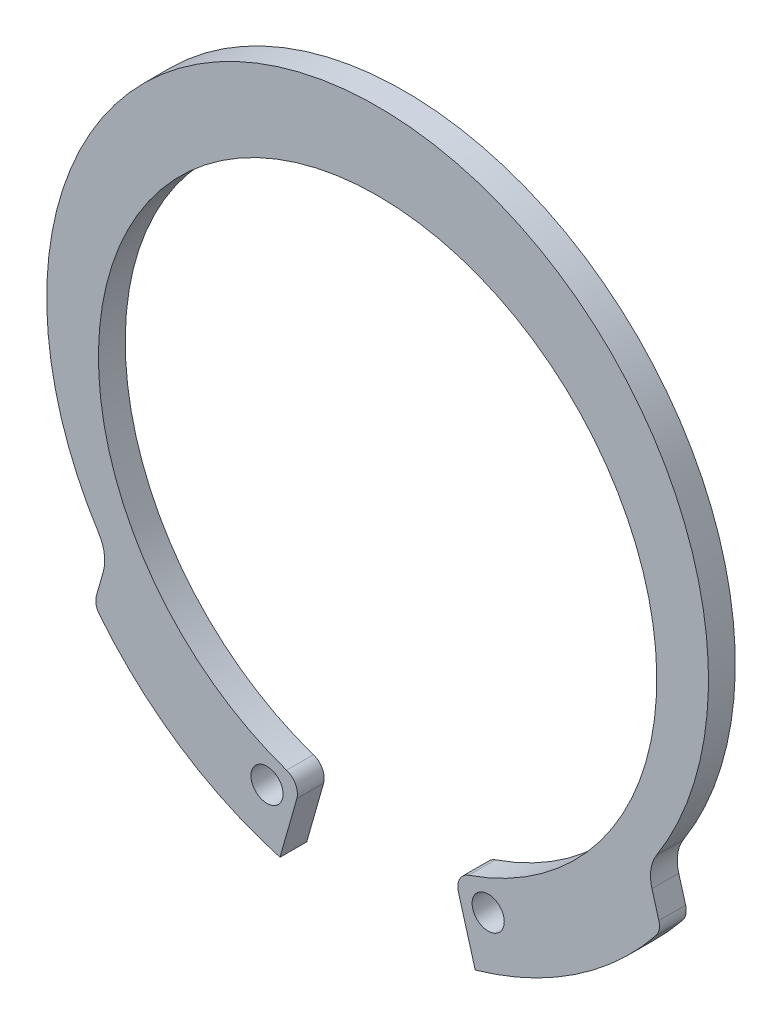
ISO-10303-21;
HEADER;
FILE_DESCRIPTION(('STEP AP214'),'2;1');
FILE_NAME('part.step','',(''),(''),'','','');
FILE_SCHEMA(('AUTOMOTIVE_DESIGN { 1 0 10303 214 1 1 1 1 }'));
ENDSEC;
DATA;
#1=APPLICATION_CONTEXT('core data for automotive mechanical design processes');
#2=APPLICATION_PROTOCOL_DEFINITION('international standard','automotive_design',2000,#1);
#3=PRODUCT_CONTEXT('',#1,'mechanical');
#4=PRODUCT('Part','Part','',(#3));
#5=PRODUCT_RELATED_PRODUCT_CATEGORY('part','',(#4));
#6=PRODUCT_DEFINITION_FORMATION('','',#4);
#7=PRODUCT_DEFINITION_CONTEXT('part definition',#1,'design');
#8=PRODUCT_DEFINITION('design','',#6,#7);
#9=PRODUCT_DEFINITION_SHAPE('','',#8);
#10=(LENGTH_UNIT() NAMED_UNIT(*) SI_UNIT(.MILLI.,.METRE.));
#11=(NAMED_UNIT(*) PLANE_ANGLE_UNIT() SI_UNIT($,.RADIAN.));
#12=(NAMED_UNIT(*) SI_UNIT($,.STERADIAN.) SOLID_ANGLE_UNIT());
#13=UNCERTAINTY_MEASURE_WITH_UNIT(LENGTH_MEASURE(1.E-05),#10,'distance_accuracy_value','');
#14=(GEOMETRIC_REPRESENTATION_CONTEXT(3) GLOBAL_UNCERTAINTY_ASSIGNED_CONTEXT((#13)) GLOBAL_UNIT_ASSIGNED_CONTEXT((#10,
#11,#12)) REPRESENTATION_CONTEXT('',''));
#15=CARTESIAN_POINT('',(0.,0.,0.));
#16=DIRECTION('',(0.,0.,1.));
#17=DIRECTION('',(1.,0.,0.));
#18=AXIS2_PLACEMENT_3D('',#15,#16,#17);
#19=CARTESIAN_POINT('',(0.,0.,-0.635));
#20=DIRECTION('',(0.,0.,1.));
#21=DIRECTION('',(1.,0.,0.));
#22=AXIS2_PLACEMENT_3D('',#19,#20,#21);
#23=CYLINDRICAL_SURFACE('',#22,8.4455);
#24=CARTESIAN_POINT('',(0.,0.,0.));
#25=DIRECTION('',(0.,0.,1.));
#26=DIRECTION('',(1.,0.,0.));
#27=AXIS2_PLACEMENT_3D('',#24,#25,#26);
#28=CIRCLE('',#27,8.4455);
#29=CARTESIAN_POINT('',(-6.59672093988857,-5.27349439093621,0.));
#30=VERTEX_POINT('',#29);
#31=CARTESIAN_POINT('',(-2.31404234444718,-8.1222951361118,0.));
#32=VERTEX_POINT('',#31);
#33=EDGE_CURVE('E165',#30,#32,#28,.T.);
#34=ORIENTED_EDGE('',*,*,#33,.F.);
#35=DIRECTION('',(0.,0.,1.));
#36=VECTOR('',#35,1.);
#37=CARTESIAN_POINT('',(-6.59672093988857,-5.27349439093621,-0.635));
#38=LINE('',#37,#36);
#39=CARTESIAN_POINT('',(-6.59672093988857,-5.27349439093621,-0.635));
#40=VERTEX_POINT('',#39);
#41=EDGE_CURVE('E11',#40,#30,#38,.T.);
#42=ORIENTED_EDGE('',*,*,#41,.F.);
#43=CARTESIAN_POINT('',(0.,0.,-0.635));
#44=DIRECTION('',(0.,0.,1.));
#45=DIRECTION('',(1.,0.,0.));
#46=AXIS2_PLACEMENT_3D('',#43,#44,#45);
#47=CIRCLE('',#46,8.4455);
#48=CARTESIAN_POINT('',(-2.31404234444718,-8.1222951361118,-0.635));
#49=VERTEX_POINT('',#48);
#50=EDGE_CURVE('E204',#40,#49,#47,.T.);
#51=ORIENTED_EDGE('',*,*,#50,.T.);
#52=DIRECTION('',(0.,0.,1.));
#53=VECTOR('',#52,1.);
#54=CARTESIAN_POINT('',(-2.31404234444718,-8.1222951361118,-0.635));
#55=LINE('',#54,#53);
#56=EDGE_CURVE('E35',#49,#32,#55,.T.);
#57=ORIENTED_EDGE('',*,*,#56,.T.);
#58=EDGE_LOOP('',(#34,#42,#51,#57));
#59=FACE_BOUND('',#58,.T.);
#60=ADVANCED_FACE('F32',(#59),#23,.T.);
#61=CARTESIAN_POINT('',(-6.29912450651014,-5.03559238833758,-0.635));
#62=DIRECTION('',(0.,0.,1.));
#63=DIRECTION('',(1.,0.,0.));
#64=AXIS2_PLACEMENT_3D('',#61,#62,#63);
#65=CYLINDRICAL_SURFACE('',#64,0.381);
#66=CARTESIAN_POINT('',(-6.29912450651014,-5.03559238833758,0.));
#67=DIRECTION('',(0.,0.,1.));
#68=DIRECTION('',(-1.,0.,0.));
#69=AXIS2_PLACEMENT_3D('',#66,#67,#68);
#70=CIRCLE('',#69,0.381);
#71=CARTESIAN_POINT('',(-6.6655438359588,-4.93119950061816,0.));
#72=VERTEX_POINT('',#71);
#73=EDGE_CURVE('E202',#72,#30,#70,.T.);
#74=ORIENTED_EDGE('',*,*,#73,.F.);
#75=DIRECTION('',(0.,0.,1.));
#76=VECTOR('',#75,1.);
#77=CARTESIAN_POINT('',(-6.6655438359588,-4.93119950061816,-0.635));
#78=LINE('',#77,#76);
#79=CARTESIAN_POINT('',(-6.6655438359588,-4.93119950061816,-0.635));
#80=VERTEX_POINT('',#79);
#81=EDGE_CURVE('E41',#80,#72,#78,.T.);
#82=ORIENTED_EDGE('',*,*,#81,.F.);
#83=CARTESIAN_POINT('',(-6.29912450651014,-5.03559238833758,-0.635));
#84=DIRECTION('',(0.,0.,1.));
#85=DIRECTION('',(-1.,0.,0.));
#86=AXIS2_PLACEMENT_3D('',#83,#84,#85);
#87=CIRCLE('',#86,0.381);
#88=EDGE_CURVE('E155',#80,#40,#87,.T.);
#89=ORIENTED_EDGE('',*,*,#88,.T.);
#90=ORIENTED_EDGE('',*,*,#41,.T.);
#91=EDGE_LOOP('',(#74,#82,#89,#90));
#92=FACE_BOUND('',#91,.T.);
#93=ADVANCED_FACE('F228',(#92),#65,.T.);
#94=CARTESIAN_POINT('',(-6.50198009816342,-4.35709032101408,-0.635));
#95=DIRECTION('',(-0.961730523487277,0.273997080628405,0.));
#96=DIRECTION('',(-0.273997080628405,-0.961730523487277,0.));
#97=AXIS2_PLACEMENT_3D('',#94,#95,#96);
#98=PLANE('',#97);
#99=DIRECTION('',(-0.273997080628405,-0.961730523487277,0.));
#100=VECTOR('',#99,1.);
#101=CARTESIAN_POINT('',(-6.50198009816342,-4.35709032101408,0.));
#102=LINE('',#101,#100);
#103=CARTESIAN_POINT('',(-6.50198009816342,-4.35709032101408,0.));
#104=VERTEX_POINT('',#103);
#105=EDGE_CURVE('E142',#104,#72,#102,.T.);
#106=ORIENTED_EDGE('',*,*,#105,.F.);
#107=DIRECTION('',(0.,0.,1.));
#108=VECTOR('',#107,1.);
#109=CARTESIAN_POINT('',(-6.50198009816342,-4.35709032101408,-0.635));
#110=LINE('',#109,#108);
#111=CARTESIAN_POINT('',(-6.50198009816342,-4.35709032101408,-0.635));
#112=VERTEX_POINT('',#111);
#113=EDGE_CURVE('E137',#112,#104,#110,.T.);
#114=ORIENTED_EDGE('',*,*,#113,.F.);
#115=DIRECTION('',(-0.273997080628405,-0.961730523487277,0.));
#116=VECTOR('',#115,1.);
#117=CARTESIAN_POINT('',(-6.50198009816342,-4.35709032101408,-0.635));
#118=LINE('',#117,#116);
#119=EDGE_CURVE('E140',#112,#80,#118,.T.);
#120=ORIENTED_EDGE('',*,*,#119,.T.);
#121=ORIENTED_EDGE('',*,*,#81,.T.);
#122=EDGE_LOOP('',(#106,#114,#120,#121));
#123=FACE_BOUND('',#122,.T.);
#124=ADVANCED_FACE('F139',(#123),#98,.T.);
#125=CARTESIAN_POINT('',(-7.37960500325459,-4.10705493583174,-0.635));
#126=DIRECTION('',(0.,0.,1.));
#127=DIRECTION('',(1.,0.,0.));
#128=AXIS2_PLACEMENT_3D('',#125,#126,#127);
#129=CYLINDRICAL_SURFACE('',#128,0.912547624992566);
#130=CARTESIAN_POINT('',(-7.37960500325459,-4.10705493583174,0.));
#131=DIRECTION('',(0.,0.,-1.));
#132=DIRECTION('',(1.,0.,0.));
#133=AXIS2_PLACEMENT_3D('',#130,#131,#132);
#134=CIRCLE('',#133,0.912547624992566);
#135=CARTESIAN_POINT('',(-6.61039615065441,-3.61607539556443,0.));
#136=VERTEX_POINT('',#135);
#137=EDGE_CURVE('E199',#136,#104,#134,.T.);
#138=ORIENTED_EDGE('',*,*,#137,.F.);
#139=DIRECTION('',(0.,0.,1.));
#140=VECTOR('',#139,1.);
#141=CARTESIAN_POINT('',(-6.61039615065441,-3.61607539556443,-0.635));
#142=LINE('',#141,#140);
#143=CARTESIAN_POINT('',(-6.61039615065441,-3.61607539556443,-0.635));
#144=VERTEX_POINT('',#143);
#145=EDGE_CURVE('E147',#144,#136,#142,.T.);
#146=ORIENTED_EDGE('',*,*,#145,.F.);
#147=CARTESIAN_POINT('',(-7.37960500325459,-4.10705493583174,-0.635));
#148=DIRECTION('',(0.,0.,-1.));
#149=DIRECTION('',(1.,0.,0.));
#150=AXIS2_PLACEMENT_3D('',#147,#148,#149);
#151=CIRCLE('',#150,0.912547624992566);
#152=EDGE_CURVE('E153',#144,#112,#151,.T.);
#153=ORIENTED_EDGE('',*,*,#152,.T.);
#154=ORIENTED_EDGE('',*,*,#113,.T.);
#155=EDGE_LOOP('',(#138,#146,#153,#154));
#156=FACE_BOUND('',#155,.T.);
#157=ADVANCED_FACE('F157',(#156),#129,.F.);
#158=CARTESIAN_POINT('',(0.,0.603284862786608,-0.635));
#159=DIRECTION('',(0.,0.,1.));
#160=DIRECTION('',(1.,0.,0.));
#161=AXIS2_PLACEMENT_3D('',#158,#159,#160);
#162=CYLINDRICAL_SURFACE('',#161,7.84221513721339);
#163=CARTESIAN_POINT('',(0.,0.603284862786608,0.));
#164=DIRECTION('',(0.,0.,1.));
#165=DIRECTION('',(1.,0.,0.));
#166=AXIS2_PLACEMENT_3D('',#163,#164,#165);
#167=CIRCLE('',#166,7.84221513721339);
#168=CARTESIAN_POINT('',(6.61039615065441,-3.61607539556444,0.));
#169=VERTEX_POINT('',#168);
#170=EDGE_CURVE('E196',#169,#136,#167,.T.);
#171=ORIENTED_EDGE('',*,*,#170,.F.);
#172=DIRECTION('',(0.,0.,1.));
#173=VECTOR('',#172,1.);
#174=CARTESIAN_POINT('',(6.61039615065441,-3.61607539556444,-0.635));
#175=LINE('',#174,#173);
#176=CARTESIAN_POINT('',(6.61039615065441,-3.61607539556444,-0.635));
#177=VERTEX_POINT('',#176);
#178=EDGE_CURVE('E208',#177,#169,#175,.T.);
#179=ORIENTED_EDGE('',*,*,#178,.F.);
#180=CARTESIAN_POINT('',(0.,0.603284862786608,-0.635));
#181=DIRECTION('',(0.,0.,1.));
#182=DIRECTION('',(1.,0.,0.));
#183=AXIS2_PLACEMENT_3D('',#180,#181,#182);
#184=CIRCLE('',#183,7.84221513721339);
#185=EDGE_CURVE('E158',#177,#144,#184,.T.);
#186=ORIENTED_EDGE('',*,*,#185,.T.);
#187=ORIENTED_EDGE('',*,*,#145,.T.);
#188=EDGE_LOOP('',(#171,#179,#186,#187));
#189=FACE_BOUND('',#188,.T.);
#190=ADVANCED_FACE('F241',(#189),#162,.T.);
#191=CARTESIAN_POINT('',(7.37960500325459,-4.10705493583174,-0.635));
#192=DIRECTION('',(0.,0.,1.));
#193=DIRECTION('',(1.,0.,0.));
#194=AXIS2_PLACEMENT_3D('',#191,#192,#193);
#195=CYLINDRICAL_SURFACE('',#194,0.912547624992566);
#196=CARTESIAN_POINT('',(7.37960500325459,-4.10705493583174,0.));
#197=DIRECTION('',(0.,0.,-1.));
#198=DIRECTION('',(1.,0.,0.));
#199=AXIS2_PLACEMENT_3D('',#196,#197,#198);
#200=CIRCLE('',#199,0.912547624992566);
#201=CARTESIAN_POINT('',(6.50198009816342,-4.35709032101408,0.));
#202=VERTEX_POINT('',#201);
#203=EDGE_CURVE('E193',#202,#169,#200,.T.);
#204=ORIENTED_EDGE('',*,*,#203,.F.);
#205=DIRECTION('',(0.,0.,1.));
#206=VECTOR('',#205,1.);
#207=CARTESIAN_POINT('',(6.50198009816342,-4.35709032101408,-0.635));
#208=LINE('',#207,#206);
#209=CARTESIAN_POINT('',(6.50198009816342,-4.35709032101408,-0.635));
#210=VERTEX_POINT('',#209);
#211=EDGE_CURVE('E210',#210,#202,#208,.T.);
#212=ORIENTED_EDGE('',*,*,#211,.F.);
#213=CARTESIAN_POINT('',(7.37960500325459,-4.10705493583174,-0.635));
#214=DIRECTION('',(0.,0.,-1.));
#215=DIRECTION('',(1.,0.,0.));
#216=AXIS2_PLACEMENT_3D('',#213,#214,#215);
#217=CIRCLE('',#216,0.912547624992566);
#218=EDGE_CURVE('E160',#210,#177,#217,.T.);
#219=ORIENTED_EDGE('',*,*,#218,.T.);
#220=ORIENTED_EDGE('',*,*,#178,.T.);
#221=EDGE_LOOP('',(#204,#212,#219,#220));
#222=FACE_BOUND('',#221,.T.);
#223=ADVANCED_FACE('F244',(#222),#195,.F.);
#224=CARTESIAN_POINT('',(6.50198009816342,-4.35709032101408,-0.635));
#225=DIRECTION('',(0.961730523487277,0.273997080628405,0.));
#226=DIRECTION('',(-0.273997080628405,0.961730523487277,0.));
#227=AXIS2_PLACEMENT_3D('',#224,#225,#226);
#228=PLANE('',#227);
#229=DIRECTION('',(-0.273997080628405,0.961730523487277,0.));
#230=VECTOR('',#229,1.);
#231=CARTESIAN_POINT('',(6.50198009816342,-4.35709032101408,0.));
#232=LINE('',#231,#230);
#233=CARTESIAN_POINT('',(6.6655438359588,-4.93119950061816,0.));
#234=VERTEX_POINT('',#233);
#235=EDGE_CURVE('E190',#234,#202,#232,.T.);
#236=ORIENTED_EDGE('',*,*,#235,.F.);
#237=DIRECTION('',(0.,0.,1.));
#238=VECTOR('',#237,1.);
#239=CARTESIAN_POINT('',(6.6655438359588,-4.93119950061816,-0.635));
#240=LINE('',#239,#238);
#241=CARTESIAN_POINT('',(6.6655438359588,-4.93119950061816,-0.635));
#242=VERTEX_POINT('',#241);
#243=EDGE_CURVE('E212',#242,#234,#240,.T.);
#244=ORIENTED_EDGE('',*,*,#243,.F.);
#245=DIRECTION('',(-0.273997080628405,0.961730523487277,0.));
#246=VECTOR('',#245,1.);
#247=CARTESIAN_POINT('',(6.50198009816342,-4.35709032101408,-0.635));
#248=LINE('',#247,#246);
#249=EDGE_CURVE('E332',#242,#210,#248,.T.);
#250=ORIENTED_EDGE('',*,*,#249,.T.);
#251=ORIENTED_EDGE('',*,*,#211,.T.);
#252=EDGE_LOOP('',(#236,#244,#250,#251));
#253=FACE_BOUND('',#252,.T.);
#254=ADVANCED_FACE('F248',(#253),#228,.T.);
#255=CARTESIAN_POINT('',(6.29912450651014,-5.03559238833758,-0.635));
#256=DIRECTION('',(0.,0.,1.));
#257=DIRECTION('',(1.,0.,0.));
#258=AXIS2_PLACEMENT_3D('',#255,#256,#257);
#259=CYLINDRICAL_SURFACE('',#258,0.381);
#260=CARTESIAN_POINT('',(6.29912450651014,-5.03559238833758,0.));
#261=DIRECTION('',(0.,0.,1.));
#262=DIRECTION('',(1.,0.,0.));
#263=AXIS2_PLACEMENT_3D('',#260,#261,#262);
#264=CIRCLE('',#263,0.381);
#265=CARTESIAN_POINT('',(6.59672093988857,-5.27349439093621,0.));
#266=VERTEX_POINT('',#265);
#267=EDGE_CURVE('E187',#266,#234,#264,.T.);
#268=ORIENTED_EDGE('',*,*,#267,.F.);
#269=DIRECTION('',(0.,0.,1.));
#270=VECTOR('',#269,1.);
#271=CARTESIAN_POINT('',(6.59672093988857,-5.27349439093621,-0.635));
#272=LINE('',#271,#270);
#273=CARTESIAN_POINT('',(6.59672093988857,-5.27349439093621,-0.635));
#274=VERTEX_POINT('',#273);
#275=EDGE_CURVE('E214',#274,#266,#272,.T.);
#276=ORIENTED_EDGE('',*,*,#275,.F.);
#277=CARTESIAN_POINT('',(6.29912450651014,-5.03559238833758,-0.635));
#278=DIRECTION('',(0.,0.,1.));
#279=DIRECTION('',(1.,0.,0.));
#280=AXIS2_PLACEMENT_3D('',#277,#278,#279);
#281=CIRCLE('',#280,0.381);
#282=EDGE_CURVE('E329',#274,#242,#281,.T.);
#283=ORIENTED_EDGE('',*,*,#282,.T.);
#284=ORIENTED_EDGE('',*,*,#243,.T.);
#285=EDGE_LOOP('',(#268,#276,#283,#284));
#286=FACE_BOUND('',#285,.T.);
#287=ADVANCED_FACE('F252',(#286),#259,.T.);
#288=CARTESIAN_POINT('',(0.,0.,-0.635));
#289=DIRECTION('',(0.,0.,1.));
#290=DIRECTION('',(1.,0.,0.));
#291=AXIS2_PLACEMENT_3D('',#288,#289,#290);
#292=CYLINDRICAL_SURFACE('',#291,8.4455);
#293=CARTESIAN_POINT('',(0.,0.,0.));
#294=DIRECTION('',(0.,0.,1.));
#295=DIRECTION('',(1.,0.,0.));
#296=AXIS2_PLACEMENT_3D('',#293,#294,#295);
#297=CIRCLE('',#296,8.4455);
#298=CARTESIAN_POINT('',(2.31404234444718,-8.1222951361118,0.));
#299=VERTEX_POINT('',#298);
#300=EDGE_CURVE('E184',#299,#266,#297,.T.);
#301=ORIENTED_EDGE('',*,*,#300,.F.);
#302=DIRECTION('',(0.,0.,1.));
#303=VECTOR('',#302,1.);
#304=CARTESIAN_POINT('',(2.31404234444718,-8.1222951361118,-0.635));
#305=LINE('',#304,#303);
#306=CARTESIAN_POINT('',(2.31404234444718,-8.1222951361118,-0.635));
#307=VERTEX_POINT('',#306);
#308=EDGE_CURVE('E216',#307,#299,#305,.T.);
#309=ORIENTED_EDGE('',*,*,#308,.F.);
#310=CARTESIAN_POINT('',(0.,0.,-0.635));
#311=DIRECTION('',(0.,0.,1.));
#312=DIRECTION('',(1.,0.,0.));
#313=AXIS2_PLACEMENT_3D('',#310,#311,#312);
#314=CIRCLE('',#313,8.4455);
#315=EDGE_CURVE('E326',#307,#274,#314,.T.);
#316=ORIENTED_EDGE('',*,*,#315,.T.);
#317=ORIENTED_EDGE('',*,*,#275,.T.);
#318=EDGE_LOOP('',(#301,#309,#316,#317));
#319=FACE_BOUND('',#318,.T.);
#320=ADVANCED_FACE('F256',(#319),#292,.T.);
#321=CARTESIAN_POINT('',(1.91450535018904,-6.7199191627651,-0.635));
#322=DIRECTION('',(-0.961730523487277,-0.273997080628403,0.));
#323=DIRECTION('',(0.273997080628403,-0.961730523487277,0.));
#324=AXIS2_PLACEMENT_3D('',#321,#322,#323);
#325=PLANE('',#324);
#326=DIRECTION('',(0.273997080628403,-0.961730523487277,0.));
#327=VECTOR('',#326,1.);
#328=CARTESIAN_POINT('',(1.91450535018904,-6.7199191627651,0.));
#329=LINE('',#328,#327);
#330=CARTESIAN_POINT('',(1.91450535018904,-6.7199191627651,0.));
#331=VERTEX_POINT('',#330);
#332=EDGE_CURVE('E181',#331,#299,#329,.T.);
#333=ORIENTED_EDGE('',*,*,#332,.F.);
#334=DIRECTION('',(0.,0.,1.));
#335=VECTOR('',#334,1.);
#336=CARTESIAN_POINT('',(1.91450535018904,-6.7199191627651,-0.635));
#337=LINE('',#336,#335);
#338=CARTESIAN_POINT('',(1.91450535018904,-6.7199191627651,-0.635));
#339=VERTEX_POINT('',#338);
#340=EDGE_CURVE('E218',#339,#331,#337,.T.);
#341=ORIENTED_EDGE('',*,*,#340,.F.);
#342=DIRECTION('',(0.273997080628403,-0.961730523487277,0.));
#343=VECTOR('',#342,1.);
#344=CARTESIAN_POINT('',(1.91450535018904,-6.7199191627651,-0.635));
#345=LINE('',#344,#343);
#346=EDGE_CURVE('E323',#339,#307,#345,.T.);
#347=ORIENTED_EDGE('',*,*,#346,.T.);
#348=ORIENTED_EDGE('',*,*,#308,.T.);
#349=EDGE_LOOP('',(#333,#341,#347,#348));
#350=FACE_BOUND('',#349,.T.);
#351=ADVANCED_FACE('F260',(#350),#325,.T.);
#352=CARTESIAN_POINT('',(2.28092467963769,-6.61552627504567,-0.635));
#353=DIRECTION('',(0.,0.,1.));
#354=DIRECTION('',(1.,0.,0.));
#355=AXIS2_PLACEMENT_3D('',#352,#353,#354);
#356=CYLINDRICAL_SURFACE('',#355,0.381);
#357=CARTESIAN_POINT('',(2.28092467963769,-6.61552627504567,0.));
#358=DIRECTION('',(0.,0.,1.));
#359=DIRECTION('',(-1.,0.,0.));
#360=AXIS2_PLACEMENT_3D('',#357,#358,#359);
#361=CIRCLE('',#360,0.381);
#362=CARTESIAN_POINT('',(2.1567364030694,-6.255334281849,0.));
#363=VERTEX_POINT('',#362);
#364=EDGE_CURVE('E178',#363,#331,#361,.T.);
#365=ORIENTED_EDGE('',*,*,#364,.F.);
#366=DIRECTION('',(0.,0.,1.));
#367=VECTOR('',#366,1.);
#368=CARTESIAN_POINT('',(2.1567364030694,-6.255334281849,-0.635));
#369=LINE('',#368,#367);
#370=CARTESIAN_POINT('',(2.1567364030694,-6.255334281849,-0.635));
#371=VERTEX_POINT('',#370);
#372=EDGE_CURVE('E220',#371,#363,#369,.T.);
#373=ORIENTED_EDGE('',*,*,#372,.F.);
#374=CARTESIAN_POINT('',(2.28092467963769,-6.61552627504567,-0.635));
#375=DIRECTION('',(0.,0.,1.));
#376=DIRECTION('',(-1.,0.,0.));
#377=AXIS2_PLACEMENT_3D('',#374,#375,#376);
#378=CIRCLE('',#377,0.381);
#379=EDGE_CURVE('E320',#371,#339,#378,.T.);
#380=ORIENTED_EDGE('',*,*,#379,.T.);
#381=ORIENTED_EDGE('',*,*,#340,.T.);
#382=EDGE_LOOP('',(#365,#373,#380,#381));
#383=FACE_BOUND('',#382,.T.);
#384=ADVANCED_FACE('F264',(#383),#356,.T.);
#385=CARTESIAN_POINT('',(0.,0.,-0.635));
#386=DIRECTION('',(0.,0.,1.));
#387=DIRECTION('',(1.,0.,0.));
#388=AXIS2_PLACEMENT_3D('',#385,#386,#387);
#389=CYLINDRICAL_SURFACE('',#388,6.6167);
#390=CARTESIAN_POINT('',(0.,0.,0.));
#391=DIRECTION('',(0.,0.,-1.));
#392=DIRECTION('',(1.,0.,0.));
#393=AXIS2_PLACEMENT_3D('',#390,#391,#392);
#394=CIRCLE('',#393,6.6167);
#395=CARTESIAN_POINT('',(-2.1567364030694,-6.255334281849,0.));
#396=VERTEX_POINT('',#395);
#397=EDGE_CURVE('E175',#396,#363,#394,.T.);
#398=ORIENTED_EDGE('',*,*,#397,.F.);
#399=DIRECTION('',(0.,0.,1.));
#400=VECTOR('',#399,1.);
#401=CARTESIAN_POINT('',(-2.1567364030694,-6.255334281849,-0.635));
#402=LINE('',#401,#400);
#403=CARTESIAN_POINT('',(-2.1567364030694,-6.255334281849,-0.635));
#404=VERTEX_POINT('',#403);
#405=EDGE_CURVE('E222',#404,#396,#402,.T.);
#406=ORIENTED_EDGE('',*,*,#405,.F.);
#407=CARTESIAN_POINT('',(0.,0.,-0.635));
#408=DIRECTION('',(0.,0.,-1.));
#409=DIRECTION('',(1.,0.,0.));
#410=AXIS2_PLACEMENT_3D('',#407,#408,#409);
#411=CIRCLE('',#410,6.6167);
#412=EDGE_CURVE('E317',#404,#371,#411,.T.);
#413=ORIENTED_EDGE('',*,*,#412,.T.);
#414=ORIENTED_EDGE('',*,*,#372,.T.);
#415=EDGE_LOOP('',(#398,#406,#413,#414));
#416=FACE_BOUND('',#415,.T.);
#417=ADVANCED_FACE('F268',(#416),#389,.F.);
#418=CARTESIAN_POINT('',(-2.28092467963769,-6.61552627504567,-0.635));
#419=DIRECTION('',(0.,0.,1.));
#420=DIRECTION('',(1.,0.,0.));
#421=AXIS2_PLACEMENT_3D('',#418,#419,#420);
#422=CYLINDRICAL_SURFACE('',#421,0.381);
#423=CARTESIAN_POINT('',(-2.28092467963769,-6.61552627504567,0.));
#424=DIRECTION('',(0.,0.,1.));
#425=DIRECTION('',(1.,0.,0.));
#426=AXIS2_PLACEMENT_3D('',#423,#424,#425);
#427=CIRCLE('',#426,0.381);
#428=CARTESIAN_POINT('',(-1.91450535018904,-6.7199191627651,0.));
#429=VERTEX_POINT('',#428);
#430=EDGE_CURVE('E172',#429,#396,#427,.T.);
#431=ORIENTED_EDGE('',*,*,#430,.F.);
#432=DIRECTION('',(0.,0.,1.));
#433=VECTOR('',#432,1.);
#434=CARTESIAN_POINT('',(-1.91450535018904,-6.7199191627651,-0.635));
#435=LINE('',#434,#433);
#436=CARTESIAN_POINT('',(-1.91450535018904,-6.7199191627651,-0.635));
#437=VERTEX_POINT('',#436);
#438=EDGE_CURVE('E223',#437,#429,#435,.T.);
#439=ORIENTED_EDGE('',*,*,#438,.F.);
#440=CARTESIAN_POINT('',(-2.28092467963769,-6.61552627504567,-0.635));
#441=DIRECTION('',(0.,0.,1.));
#442=DIRECTION('',(1.,0.,0.));
#443=AXIS2_PLACEMENT_3D('',#440,#441,#442);
#444=CIRCLE('',#443,0.381);
#445=EDGE_CURVE('E314',#437,#404,#444,.T.);
#446=ORIENTED_EDGE('',*,*,#445,.T.);
#447=ORIENTED_EDGE('',*,*,#405,.T.);
#448=EDGE_LOOP('',(#431,#439,#446,#447));
#449=FACE_BOUND('',#448,.T.);
#450=ADVANCED_FACE('F272',(#449),#422,.T.);
#451=CARTESIAN_POINT('',(-1.91450535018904,-6.7199191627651,-0.635));
#452=DIRECTION('',(0.961730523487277,-0.273997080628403,0.));
#453=DIRECTION('',(0.273997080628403,0.961730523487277,0.));
#454=AXIS2_PLACEMENT_3D('',#451,#452,#453);
#455=PLANE('',#454);
#456=DIRECTION('',(0.273997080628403,0.961730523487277,0.));
#457=VECTOR('',#456,1.);
#458=CARTESIAN_POINT('',(-1.91450535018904,-6.7199191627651,0.));
#459=LINE('',#458,#457);
#460=EDGE_CURVE('E168',#32,#429,#459,.T.);
#461=ORIENTED_EDGE('',*,*,#460,.F.);
#462=ORIENTED_EDGE('',*,*,#56,.F.);
#463=DIRECTION('',(0.273997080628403,0.961730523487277,0.));
#464=VECTOR('',#463,1.);
#465=CARTESIAN_POINT('',(-1.91450535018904,-6.7199191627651,-0.635));
#466=LINE('',#465,#464);
#467=EDGE_CURVE('E312',#49,#437,#466,.T.);
#468=ORIENTED_EDGE('',*,*,#467,.T.);
#469=ORIENTED_EDGE('',*,*,#438,.T.);
#470=EDGE_LOOP('',(#461,#462,#468,#469));
#471=FACE_BOUND('',#470,.T.);
#472=ADVANCED_FACE('F225',(#471),#455,.T.);
#473=CARTESIAN_POINT('',(0.,0.,-0.635));
#474=DIRECTION('',(0.,0.,1.));
#475=DIRECTION('',(1.,0.,0.));
#476=AXIS2_PLACEMENT_3D('',#473,#474,#475);
#477=PLANE('',#476);
#478=CARTESIAN_POINT('',(-2.62080347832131,-6.78878292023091,-0.635));
#479=DIRECTION('',(0.,0.,1.));
#480=DIRECTION('',(1.,0.,0.));
#481=AXIS2_PLACEMENT_3D('',#478,#479,#480);
#482=CIRCLE('',#481,0.381);
#483=CARTESIAN_POINT('',(-2.23980347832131,-6.78878292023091,-0.635));
#484=VERTEX_POINT('',#483);
#485=EDGE_CURVE('E299',#484,#484,#482,.T.);
#486=ORIENTED_EDGE('',*,*,#485,.T.);
#487=EDGE_LOOP('',(#486));
#488=FACE_BOUND('',#487,.T.);
#489=CARTESIAN_POINT('',(2.62080347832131,-6.78878292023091,-0.635));
#490=DIRECTION('',(0.,0.,1.));
#491=DIRECTION('',(1.,0.,0.));
#492=AXIS2_PLACEMENT_3D('',#489,#490,#491);
#493=CIRCLE('',#492,0.381);
#494=CARTESIAN_POINT('',(3.00180347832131,-6.78878292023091,-0.635));
#495=VERTEX_POINT('',#494);
#496=EDGE_CURVE('E169',#495,#495,#493,.T.);
#497=ORIENTED_EDGE('',*,*,#496,.T.);
#498=EDGE_LOOP('',(#497));
#499=FACE_BOUND('',#498,.T.);
#500=ORIENTED_EDGE('',*,*,#50,.F.);
#501=ORIENTED_EDGE('',*,*,#88,.F.);
#502=ORIENTED_EDGE('',*,*,#119,.F.);
#503=ORIENTED_EDGE('',*,*,#152,.F.);
#504=ORIENTED_EDGE('',*,*,#185,.F.);
#505=ORIENTED_EDGE('',*,*,#218,.F.);
#506=ORIENTED_EDGE('',*,*,#249,.F.);
#507=ORIENTED_EDGE('',*,*,#282,.F.);
#508=ORIENTED_EDGE('',*,*,#315,.F.);
#509=ORIENTED_EDGE('',*,*,#346,.F.);
#510=ORIENTED_EDGE('',*,*,#379,.F.);
#511=ORIENTED_EDGE('',*,*,#412,.F.);
#512=ORIENTED_EDGE('',*,*,#445,.F.);
#513=ORIENTED_EDGE('',*,*,#467,.F.);
#514=EDGE_LOOP('',(#500,#501,#502,#503,#504,#505,#506,#507,#508,#509,#510,#511,#512,#513));
#515=FACE_BOUND('',#514,.T.);
#516=ADVANCED_FACE('F151',(#488,#499,#515),#477,.F.);
#517=CARTESIAN_POINT('',(0.,0.,0.));
#518=DIRECTION('',(0.,0.,1.));
#519=DIRECTION('',(1.,0.,0.));
#520=AXIS2_PLACEMENT_3D('',#517,#518,#519);
#521=PLANE('',#520);
#522=CARTESIAN_POINT('',(-2.62080347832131,-6.78878292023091,0.));
#523=DIRECTION('',(0.,0.,1.));
#524=DIRECTION('',(1.,0.,0.));
#525=AXIS2_PLACEMENT_3D('',#522,#523,#524);
#526=CIRCLE('',#525,0.381);
#527=CARTESIAN_POINT('',(-2.23980347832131,-6.78878292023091,0.));
#528=VERTEX_POINT('',#527);
#529=EDGE_CURVE('E302',#528,#528,#526,.T.);
#530=ORIENTED_EDGE('',*,*,#529,.F.);
#531=EDGE_LOOP('',(#530));
#532=FACE_BOUND('',#531,.T.);
#533=CARTESIAN_POINT('',(2.62080347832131,-6.78878292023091,0.));
#534=DIRECTION('',(0.,0.,1.));
#535=DIRECTION('',(1.,0.,0.));
#536=AXIS2_PLACEMENT_3D('',#533,#534,#535);
#537=CIRCLE('',#536,0.381);
#538=CARTESIAN_POINT('',(3.00180347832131,-6.78878292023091,0.));
#539=VERTEX_POINT('',#538);
#540=EDGE_CURVE('E304',#539,#539,#537,.T.);
#541=ORIENTED_EDGE('',*,*,#540,.F.);
#542=EDGE_LOOP('',(#541));
#543=FACE_BOUND('',#542,.T.);
#544=ORIENTED_EDGE('',*,*,#33,.T.);
#545=ORIENTED_EDGE('',*,*,#460,.T.);
#546=ORIENTED_EDGE('',*,*,#430,.T.);
#547=ORIENTED_EDGE('',*,*,#397,.T.);
#548=ORIENTED_EDGE('',*,*,#364,.T.);
#549=ORIENTED_EDGE('',*,*,#332,.T.);
#550=ORIENTED_EDGE('',*,*,#300,.T.);
#551=ORIENTED_EDGE('',*,*,#267,.T.);
#552=ORIENTED_EDGE('',*,*,#235,.T.);
#553=ORIENTED_EDGE('',*,*,#203,.T.);
#554=ORIENTED_EDGE('',*,*,#170,.T.);
#555=ORIENTED_EDGE('',*,*,#137,.T.);
#556=ORIENTED_EDGE('',*,*,#105,.T.);
#557=ORIENTED_EDGE('',*,*,#73,.T.);
#558=EDGE_LOOP('',(#544,#545,#546,#547,#548,#549,#550,#551,#552,#553,#554,#555,#556,#557));
#559=FACE_BOUND('',#558,.T.);
#560=ADVANCED_FACE('F227',(#532,#543,#559),#521,.T.);
#561=CARTESIAN_POINT('',(2.62080347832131,-6.78878292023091,-0.635));
#562=DIRECTION('',(0.,0.,1.));
#563=DIRECTION('',(1.,0.,0.));
#564=AXIS2_PLACEMENT_3D('',#561,#562,#563);
#565=CYLINDRICAL_SURFACE('',#564,0.381);
#566=ORIENTED_EDGE('',*,*,#496,.F.);
#567=EDGE_LOOP('',(#566));
#568=FACE_BOUND('',#567,.T.);
#569=ORIENTED_EDGE('',*,*,#540,.T.);
#570=EDGE_LOOP('',(#569));
#571=FACE_BOUND('',#570,.T.);
#572=ADVANCED_FACE('F284',(#568,#571),#565,.F.);
#573=CARTESIAN_POINT('',(-2.62080347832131,-6.78878292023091,-0.635));
#574=DIRECTION('',(0.,0.,1.));
#575=DIRECTION('',(1.,0.,0.));
#576=AXIS2_PLACEMENT_3D('',#573,#574,#575);
#577=CYLINDRICAL_SURFACE('',#576,0.381);
#578=ORIENTED_EDGE('',*,*,#485,.F.);
#579=EDGE_LOOP('',(#578));
#580=FACE_BOUND('',#579,.T.);
#581=ORIENTED_EDGE('',*,*,#529,.T.);
#582=EDGE_LOOP('',(#581));
#583=FACE_BOUND('',#582,.T.);
#584=ADVANCED_FACE('F291',(#580,#583),#577,.F.);
#585=CLOSED_SHELL('',(#60,#93,#124,#157,#190,#223,#254,#287,#320,#351,#384,#417,#450,#472,#516,
#560,#572,#584));
#586=MANIFOLD_SOLID_BREP('B2',#585);
#587=ADVANCED_BREP_SHAPE_REPRESENTATION('',(#18,#586),#14);
#588=SHAPE_DEFINITION_REPRESENTATION(#9,#587);
ENDSEC;
END-ISO-10303-21;
